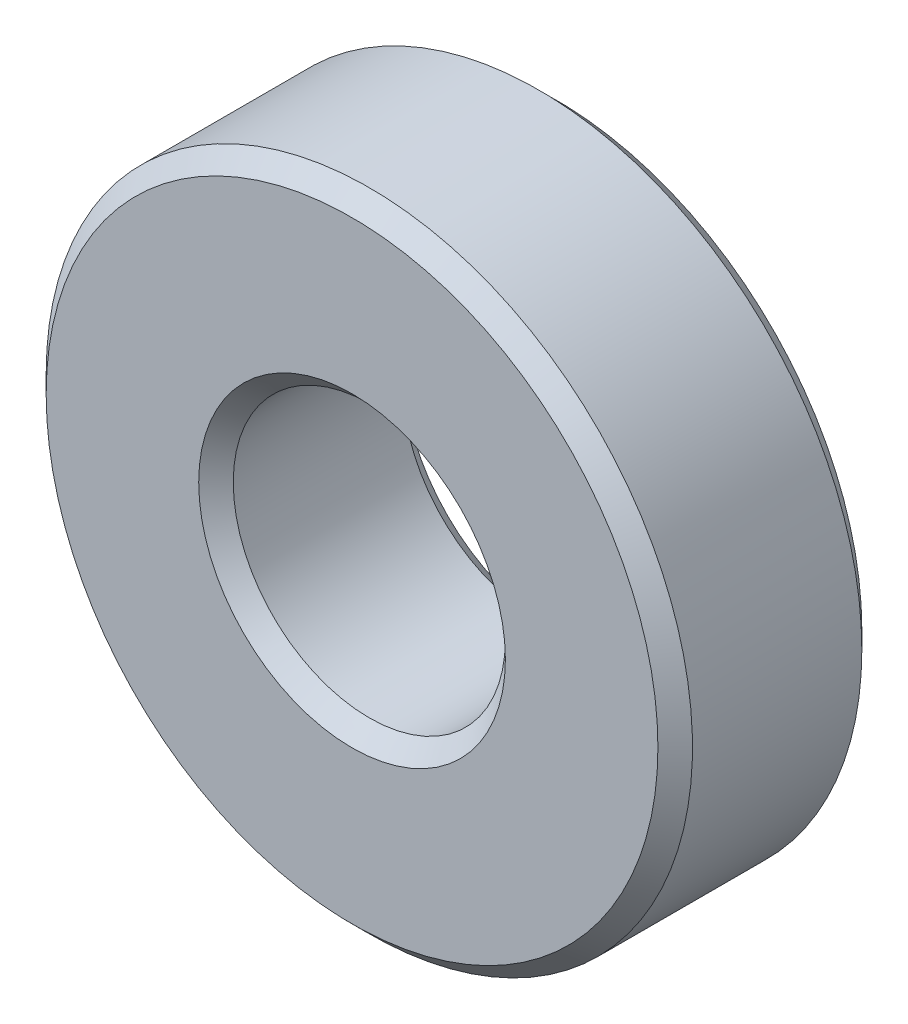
ISO-10303-21;
HEADER;
FILE_DESCRIPTION(('STEP AP214'),'2;1');
FILE_NAME('part.step','',(''),(''),'','','');
FILE_SCHEMA(('AUTOMOTIVE_DESIGN { 1 0 10303 214 1 1 1 1 }'));
ENDSEC;
DATA;
#1=APPLICATION_CONTEXT('core data for automotive mechanical design processes');
#2=APPLICATION_PROTOCOL_DEFINITION('international standard','automotive_design',2000,#1);
#3=PRODUCT_CONTEXT('',#1,'mechanical');
#4=PRODUCT('Part','Part','',(#3));
#5=PRODUCT_RELATED_PRODUCT_CATEGORY('part','',(#4));
#6=PRODUCT_DEFINITION_FORMATION('','',#4);
#7=PRODUCT_DEFINITION_CONTEXT('part definition',#1,'design');
#8=PRODUCT_DEFINITION('design','',#6,#7);
#9=PRODUCT_DEFINITION_SHAPE('','',#8);
#10=(LENGTH_UNIT() NAMED_UNIT(*) SI_UNIT(.MILLI.,.METRE.));
#11=(NAMED_UNIT(*) PLANE_ANGLE_UNIT() SI_UNIT($,.RADIAN.));
#12=(NAMED_UNIT(*) SI_UNIT($,.STERADIAN.) SOLID_ANGLE_UNIT());
#13=UNCERTAINTY_MEASURE_WITH_UNIT(LENGTH_MEASURE(1.E-05),#10,'distance_accuracy_value','');
#14=(GEOMETRIC_REPRESENTATION_CONTEXT(3) GLOBAL_UNCERTAINTY_ASSIGNED_CONTEXT((#13)) GLOBAL_UNIT_ASSIGNED_CONTEXT((#10,
#11,#12)) REPRESENTATION_CONTEXT('',''));
#15=CARTESIAN_POINT('',(0.,0.,0.));
#16=DIRECTION('',(0.,0.,1.));
#17=DIRECTION('',(1.,0.,0.));
#18=AXIS2_PLACEMENT_3D('',#15,#16,#17);
#19=CARTESIAN_POINT('',(0.,0.,5.9944));
#20=DIRECTION('',(0.,0.,1.));
#21=DIRECTION('',(1.,0.,0.));
#22=AXIS2_PLACEMENT_3D('',#19,#20,#21);
#23=PLANE('',#22);
#24=CARTESIAN_POINT('',(0.,0.,5.9944));
#25=DIRECTION('',(0.,0.,1.));
#26=DIRECTION('',(1.,0.,0.));
#27=AXIS2_PLACEMENT_3D('',#24,#25,#26);
#28=CIRCLE('',#27,4.50800000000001);
#29=CARTESIAN_POINT('',(4.50800000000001,0.,5.9944));
#30=VERTEX_POINT('',#29);
#31=EDGE_CURVE('E10',#30,#30,#28,.F.);
#32=ORIENTED_EDGE('',*,*,#31,.T.);
#33=EDGE_LOOP('',(#32));
#34=FACE_BOUND('',#33,.T.);
#35=CARTESIAN_POINT('',(0.,0.,5.9944));
#36=DIRECTION('',(0.,0.,1.));
#37=DIRECTION('',(1.,0.,0.));
#38=AXIS2_PLACEMENT_3D('',#35,#36,#37);
#39=CIRCLE('',#38,8.99200000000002);
#40=CARTESIAN_POINT('',(8.99200000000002,0.,5.9944));
#41=VERTEX_POINT('',#40);
#42=EDGE_CURVE('E40',#41,#41,#39,.T.);
#43=ORIENTED_EDGE('',*,*,#42,.T.);
#44=EDGE_LOOP('',(#43));
#45=FACE_BOUND('',#44,.T.);
#46=ADVANCED_FACE('F33',(#34,#45),#23,.T.);
#47=CARTESIAN_POINT('',(0.,0.,0.));
#48=DIRECTION('',(0.,0.,1.));
#49=DIRECTION('',(1.,0.,0.));
#50=AXIS2_PLACEMENT_3D('',#47,#48,#49);
#51=PLANE('',#50);
#52=CARTESIAN_POINT('',(0.,0.,0.));
#53=DIRECTION('',(0.,0.,1.));
#54=DIRECTION('',(1.,0.,0.));
#55=AXIS2_PLACEMENT_3D('',#52,#53,#54);
#56=CIRCLE('',#55,4.50799999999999);
#57=CARTESIAN_POINT('',(4.50799999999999,0.,0.));
#58=VERTEX_POINT('',#57);
#59=EDGE_CURVE('E59',#58,#58,#56,.T.);
#60=ORIENTED_EDGE('',*,*,#59,.T.);
#61=EDGE_LOOP('',(#60));
#62=FACE_BOUND('',#61,.T.);
#63=CARTESIAN_POINT('',(0.,0.,0.));
#64=DIRECTION('',(0.,0.,1.));
#65=DIRECTION('',(1.,0.,0.));
#66=AXIS2_PLACEMENT_3D('',#63,#64,#65);
#67=CIRCLE('',#66,8.99199999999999);
#68=CARTESIAN_POINT('',(8.99199999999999,0.,0.));
#69=VERTEX_POINT('',#68);
#70=EDGE_CURVE('E62',#69,#69,#67,.F.);
#71=ORIENTED_EDGE('',*,*,#70,.T.);
#72=EDGE_LOOP('',(#71));
#73=FACE_BOUND('',#72,.T.);
#74=ADVANCED_FACE('F66',(#62,#73),#51,.F.);
#75=CARTESIAN_POINT('',(0.,0.,5.9944));
#76=DIRECTION('',(0.,0.,-1.));
#77=DIRECTION('',(-1.,0.,0.));
#78=AXIS2_PLACEMENT_3D('',#75,#76,#77);
#79=CYLINDRICAL_SURFACE('',#78,9.5);
#80=CARTESIAN_POINT('',(0.,0.,0.508000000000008));
#81=DIRECTION('',(0.,0.,1.));
#82=DIRECTION('',(1.,0.,0.));
#83=AXIS2_PLACEMENT_3D('',#80,#81,#82);
#84=CIRCLE('',#83,9.5);
#85=CARTESIAN_POINT('',(-9.5,0.,0.508000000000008));
#86=VERTEX_POINT('',#85);
#87=EDGE_CURVE('E44',#86,#86,#84,.T.);
#88=CARTESIAN_POINT('',(0.,0.,5.48640000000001));
#89=DIRECTION('',(0.,0.,1.));
#90=DIRECTION('',(1.,0.,0.));
#91=AXIS2_PLACEMENT_3D('',#88,#89,#90);
#92=CIRCLE('',#91,9.5);
#93=CARTESIAN_POINT('',(-9.5,0.,5.48640000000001));
#94=VERTEX_POINT('',#93);
#95=EDGE_CURVE('E48',#94,#94,#92,.F.);
#96=CARTESIAN_POINT('',(-9.5,0.,0.508000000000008));
#97=CARTESIAN_POINT('',(-9.5,0.,0.559858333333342));
#98=CARTESIAN_POINT('',(-9.5,0.,0.611716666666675));
#99=CARTESIAN_POINT('',(-9.5,0.,0.715433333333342));
#100=CARTESIAN_POINT('',(-9.5,0.,0.767291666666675));
#101=CARTESIAN_POINT('',(-9.5,0.,0.871008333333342));
#102=CARTESIAN_POINT('',(-9.5,0.,0.922866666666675));
#103=CARTESIAN_POINT('',(-9.5,0.,1.02658333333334));
#104=CARTESIAN_POINT('',(-9.5,0.,1.07844166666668));
#105=CARTESIAN_POINT('',(-9.5,0.,1.18215833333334));
#106=CARTESIAN_POINT('',(-9.5,0.,1.23401666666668));
#107=CARTESIAN_POINT('',(-9.5,0.,1.33773333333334));
#108=CARTESIAN_POINT('',(-9.5,0.,1.38959166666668));
#109=CARTESIAN_POINT('',(-9.5,0.,1.49330833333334));
#110=CARTESIAN_POINT('',(-9.5,0.,1.54516666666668));
#111=CARTESIAN_POINT('',(-9.5,0.,1.64888333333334));
#112=CARTESIAN_POINT('',(-9.5,0.,1.70074166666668));
#113=CARTESIAN_POINT('',(-9.5,0.,1.80445833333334));
#114=CARTESIAN_POINT('',(-9.5,0.,1.85631666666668));
#115=CARTESIAN_POINT('',(-9.5,0.,1.96003333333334));
#116=CARTESIAN_POINT('',(-9.5,0.,2.01189166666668));
#117=CARTESIAN_POINT('',(-9.5,0.,2.11560833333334));
#118=CARTESIAN_POINT('',(-9.5,0.,2.16746666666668));
#119=CARTESIAN_POINT('',(-9.5,0.,2.27118333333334));
#120=CARTESIAN_POINT('',(-9.5,0.,2.32304166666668));
#121=CARTESIAN_POINT('',(-9.5,0.,2.42675833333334));
#122=CARTESIAN_POINT('',(-9.5,0.,2.47861666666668));
#123=CARTESIAN_POINT('',(-9.5,0.,2.58233333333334));
#124=CARTESIAN_POINT('',(-9.5,0.,2.63419166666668));
#125=CARTESIAN_POINT('',(-9.5,0.,2.73790833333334));
#126=CARTESIAN_POINT('',(-9.5,0.,2.78976666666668));
#127=CARTESIAN_POINT('',(-9.5,0.,2.89348333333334));
#128=CARTESIAN_POINT('',(-9.5,0.,2.94534166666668));
#129=CARTESIAN_POINT('',(-9.5,0.,3.04905833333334));
#130=CARTESIAN_POINT('',(-9.5,0.,3.10091666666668));
#131=CARTESIAN_POINT('',(-9.5,0.,3.20463333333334));
#132=CARTESIAN_POINT('',(-9.5,0.,3.25649166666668));
#133=CARTESIAN_POINT('',(-9.5,0.,3.36020833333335));
#134=CARTESIAN_POINT('',(-9.5,0.,3.41206666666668));
#135=CARTESIAN_POINT('',(-9.5,0.,3.51578333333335));
#136=CARTESIAN_POINT('',(-9.5,0.,3.56764166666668));
#137=CARTESIAN_POINT('',(-9.5,0.,3.67135833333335));
#138=CARTESIAN_POINT('',(-9.5,0.,3.72321666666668));
#139=CARTESIAN_POINT('',(-9.5,0.,3.82693333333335));
#140=CARTESIAN_POINT('',(-9.5,0.,3.87879166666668));
#141=CARTESIAN_POINT('',(-9.5,0.,3.98250833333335));
#142=CARTESIAN_POINT('',(-9.5,0.,4.03436666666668));
#143=CARTESIAN_POINT('',(-9.5,0.,4.13808333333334));
#144=CARTESIAN_POINT('',(-9.5,0.,4.18994166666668));
#145=CARTESIAN_POINT('',(-9.5,0.,4.29365833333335));
#146=CARTESIAN_POINT('',(-9.5,0.,4.34551666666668));
#147=CARTESIAN_POINT('',(-9.5,0.,4.44923333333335));
#148=CARTESIAN_POINT('',(-9.5,0.,4.50109166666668));
#149=CARTESIAN_POINT('',(-9.5,0.,4.60480833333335));
#150=CARTESIAN_POINT('',(-9.5,0.,4.65666666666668));
#151=CARTESIAN_POINT('',(-9.5,0.,4.76038333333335));
#152=CARTESIAN_POINT('',(-9.5,0.,4.81224166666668));
#153=CARTESIAN_POINT('',(-9.5,0.,4.91595833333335));
#154=CARTESIAN_POINT('',(-9.5,0.,4.96781666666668));
#155=CARTESIAN_POINT('',(-9.5,0.,5.07153333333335));
#156=CARTESIAN_POINT('',(-9.5,0.,5.12339166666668));
#157=CARTESIAN_POINT('',(-9.5,0.,5.22710833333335));
#158=CARTESIAN_POINT('',(-9.5,0.,5.27896666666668));
#159=CARTESIAN_POINT('',(-9.5,0.,5.38268333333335));
#160=CARTESIAN_POINT('',(-9.5,0.,5.43454166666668));
#161=CARTESIAN_POINT('',(-9.5,0.,5.48640000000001));
#162=B_SPLINE_CURVE_WITH_KNOTS('',3,(#96,#97,#98,#99,#100,#101,#102,#103,#104,#105,#106,#107,
#108,#109,#110,#111,#112,#113,#114,#115,#116,#117,#118,#119,#120,#121,#122,#123,#124,#125,#126,
#127,#128,#129,#130,#131,#132,#133,#134,#135,#136,#137,#138,#139,#140,#141,#142,#143,#144,#145,
#146,#147,#148,#149,#150,#151,#152,#153,#154,#155,#156,#157,#158,#159,#160,#161),.UNSPECIFIED.,
.F.,.F.,(4,2,2,2,2,2,2,2,2,2,2,2,2,2,2,2,2,2,2,2,2,2,2,2,2,2,2,2,2,2,2,2,4),(0.,0.155575,
0.31115,0.466725,0.622300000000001,0.777875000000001,0.933450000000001,1.089025,1.2446,1.400175,
1.55575,1.711325,1.8669,2.022475,2.17805,2.333625,2.4892,2.644775,2.80035,2.955925,3.1115,
3.267075,3.42265,3.578225,3.7338,3.889375,4.04495,4.200525,4.3561,4.511675,4.66725,
4.82282500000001,4.97840000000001),.UNSPECIFIED.);
#163=EDGE_CURVE('BSEAM76',#86,#94,#162,.T.);
#164=ORIENTED_EDGE('',*,*,#87,.T.);
#165=ORIENTED_EDGE('',*,*,#95,.T.);
#166=ORIENTED_EDGE('',*,*,#163,.T.);
#167=ORIENTED_EDGE('',*,*,#163,.F.);
#168=EDGE_LOOP('',(#164,#166,#165,#167));
#169=FACE_BOUND('',#168,.T.);
#170=ADVANCED_FACE('F76',(#169),#79,.T.);
#171=CARTESIAN_POINT('',(0.,0.,5.9944));
#172=DIRECTION('',(0.,0.,-1.));
#173=DIRECTION('',(-1.,0.,0.));
#174=AXIS2_PLACEMENT_3D('',#171,#172,#173);
#175=CYLINDRICAL_SURFACE('',#174,4.);
#176=CARTESIAN_POINT('',(0.,0.,0.507999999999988));
#177=DIRECTION('',(0.,0.,1.));
#178=DIRECTION('',(1.,0.,0.));
#179=AXIS2_PLACEMENT_3D('',#176,#177,#178);
#180=CIRCLE('',#179,4.);
#181=CARTESIAN_POINT('',(-4.,0.,0.507999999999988));
#182=VERTEX_POINT('',#181);
#183=EDGE_CURVE('E53',#182,#182,#180,.F.);
#184=CARTESIAN_POINT('',(0.,0.,5.48639999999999));
#185=DIRECTION('',(0.,0.,1.));
#186=DIRECTION('',(1.,0.,0.));
#187=AXIS2_PLACEMENT_3D('',#184,#185,#186);
#188=CIRCLE('',#187,4.);
#189=CARTESIAN_POINT('',(-4.,0.,5.48639999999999));
#190=VERTEX_POINT('',#189);
#191=EDGE_CURVE('E56',#190,#190,#188,.T.);
#192=CARTESIAN_POINT('',(-4.,0.,0.507999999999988));
#193=CARTESIAN_POINT('',(-4.,0.,0.559858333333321));
#194=CARTESIAN_POINT('',(-4.,0.,0.611716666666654));
#195=CARTESIAN_POINT('',(-4.,0.,0.715433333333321));
#196=CARTESIAN_POINT('',(-4.,0.,0.767291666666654));
#197=CARTESIAN_POINT('',(-4.,0.,0.871008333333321));
#198=CARTESIAN_POINT('',(-4.,0.,0.922866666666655));
#199=CARTESIAN_POINT('',(-4.,0.,1.02658333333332));
#200=CARTESIAN_POINT('',(-4.,0.,1.07844166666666));
#201=CARTESIAN_POINT('',(-4.,0.,1.18215833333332));
#202=CARTESIAN_POINT('',(-4.,0.,1.23401666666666));
#203=CARTESIAN_POINT('',(-4.,0.,1.33773333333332));
#204=CARTESIAN_POINT('',(-4.,0.,1.38959166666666));
#205=CARTESIAN_POINT('',(-4.,0.,1.49330833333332));
#206=CARTESIAN_POINT('',(-4.,0.,1.54516666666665));
#207=CARTESIAN_POINT('',(-4.,0.,1.64888333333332));
#208=CARTESIAN_POINT('',(-4.,0.,1.70074166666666));
#209=CARTESIAN_POINT('',(-4.,0.,1.80445833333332));
#210=CARTESIAN_POINT('',(-4.,0.,1.85631666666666));
#211=CARTESIAN_POINT('',(-4.,0.,1.96003333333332));
#212=CARTESIAN_POINT('',(-4.,0.,2.01189166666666));
#213=CARTESIAN_POINT('',(-4.,0.,2.11560833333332));
#214=CARTESIAN_POINT('',(-4.,0.,2.16746666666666));
#215=CARTESIAN_POINT('',(-4.,0.,2.27118333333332));
#216=CARTESIAN_POINT('',(-4.,0.,2.32304166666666));
#217=CARTESIAN_POINT('',(-4.,0.,2.42675833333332));
#218=CARTESIAN_POINT('',(-4.,0.,2.47861666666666));
#219=CARTESIAN_POINT('',(-4.,0.,2.58233333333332));
#220=CARTESIAN_POINT('',(-4.,0.,2.63419166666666));
#221=CARTESIAN_POINT('',(-4.,0.,2.73790833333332));
#222=CARTESIAN_POINT('',(-4.,0.,2.78976666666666));
#223=CARTESIAN_POINT('',(-4.,0.,2.89348333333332));
#224=CARTESIAN_POINT('',(-4.,0.,2.94534166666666));
#225=CARTESIAN_POINT('',(-4.,0.,3.04905833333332));
#226=CARTESIAN_POINT('',(-4.,0.,3.10091666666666));
#227=CARTESIAN_POINT('',(-4.,0.,3.20463333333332));
#228=CARTESIAN_POINT('',(-4.,0.,3.25649166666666));
#229=CARTESIAN_POINT('',(-4.,0.,3.36020833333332));
#230=CARTESIAN_POINT('',(-4.,0.,3.41206666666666));
#231=CARTESIAN_POINT('',(-4.,0.,3.51578333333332));
#232=CARTESIAN_POINT('',(-4.,0.,3.56764166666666));
#233=CARTESIAN_POINT('',(-4.,0.,3.67135833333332));
#234=CARTESIAN_POINT('',(-4.,0.,3.72321666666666));
#235=CARTESIAN_POINT('',(-4.,0.,3.82693333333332));
#236=CARTESIAN_POINT('',(-4.,0.,3.87879166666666));
#237=CARTESIAN_POINT('',(-4.,0.,3.98250833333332));
#238=CARTESIAN_POINT('',(-4.,0.,4.03436666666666));
#239=CARTESIAN_POINT('',(-4.,0.,4.13808333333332));
#240=CARTESIAN_POINT('',(-4.,0.,4.18994166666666));
#241=CARTESIAN_POINT('',(-4.,0.,4.29365833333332));
#242=CARTESIAN_POINT('',(-4.,0.,4.34551666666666));
#243=CARTESIAN_POINT('',(-4.,0.,4.44923333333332));
#244=CARTESIAN_POINT('',(-4.,0.,4.50109166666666));
#245=CARTESIAN_POINT('',(-4.,0.,4.60480833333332));
#246=CARTESIAN_POINT('',(-4.,0.,4.65666666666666));
#247=CARTESIAN_POINT('',(-4.,0.,4.76038333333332));
#248=CARTESIAN_POINT('',(-4.,0.,4.81224166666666));
#249=CARTESIAN_POINT('',(-4.,0.,4.91595833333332));
#250=CARTESIAN_POINT('',(-4.,0.,4.96781666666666));
#251=CARTESIAN_POINT('',(-4.,0.,5.07153333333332));
#252=CARTESIAN_POINT('',(-4.,0.,5.12339166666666));
#253=CARTESIAN_POINT('',(-4.,0.,5.22710833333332));
#254=CARTESIAN_POINT('',(-4.,0.,5.27896666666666));
#255=CARTESIAN_POINT('',(-4.,0.,5.38268333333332));
#256=CARTESIAN_POINT('',(-4.,0.,5.43454166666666));
#257=CARTESIAN_POINT('',(-4.,0.,5.48639999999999));
#258=B_SPLINE_CURVE_WITH_KNOTS('',3,(#192,#193,#194,#195,#196,#197,#198,#199,#200,#201,#202,
#203,#204,#205,#206,#207,#208,#209,#210,#211,#212,#213,#214,#215,#216,#217,#218,#219,#220,#221,
#222,#223,#224,#225,#226,#227,#228,#229,#230,#231,#232,#233,#234,#235,#236,#237,#238,#239,#240,
#241,#242,#243,#244,#245,#246,#247,#248,#249,#250,#251,#252,#253,#254,#255,#256,#257),
.UNSPECIFIED.,.F.,.F.,(4,2,2,2,2,2,2,2,2,2,2,2,2,2,2,2,2,2,2,2,2,2,2,2,2,2,2,2,2,2,2,2,4),(0.,
0.155575,0.31115,0.466725,0.622300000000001,0.777875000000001,0.933450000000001,1.089025,1.2446,
1.400175,1.55575,1.711325,1.8669,2.022475,2.17805,2.333625,2.4892,2.644775,2.80035,2.955925,
3.1115,3.267075,3.42265,3.578225,3.7338,3.889375,4.04495,4.200525,4.3561,4.511675,4.66725,
4.822825,4.9784),.UNSPECIFIED.);
#259=EDGE_CURVE('BSEAM79',#182,#190,#258,.T.);
#260=ORIENTED_EDGE('',*,*,#183,.T.);
#261=ORIENTED_EDGE('',*,*,#191,.T.);
#262=ORIENTED_EDGE('',*,*,#259,.T.);
#263=ORIENTED_EDGE('',*,*,#259,.F.);
#264=EDGE_LOOP('',(#260,#262,#261,#263));
#265=FACE_BOUND('',#264,.T.);
#266=ADVANCED_FACE('F79',(#265),#175,.F.);
#267=CARTESIAN_POINT('',(0.,0.,0.));
#268=DIRECTION('',(0.,0.,-1.));
#269=DIRECTION('',(-1.,0.,0.));
#270=AXIS2_PLACEMENT_3D('',#267,#268,#269);
#271=CONICAL_SURFACE('',#270,4.50799999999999,0.785398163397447);
#272=ORIENTED_EDGE('',*,*,#183,.F.);
#273=EDGE_LOOP('',(#272));
#274=FACE_BOUND('',#273,.T.);
#275=ORIENTED_EDGE('',*,*,#59,.F.);
#276=EDGE_LOOP('',(#275));
#277=FACE_BOUND('',#276,.T.);
#278=ADVANCED_FACE('F72',(#274,#277),#271,.F.);
#279=CARTESIAN_POINT('',(0.,0.,0.508000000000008));
#280=DIRECTION('',(0.,0.,1.));
#281=DIRECTION('',(1.,0.,0.));
#282=AXIS2_PLACEMENT_3D('',#279,#280,#281);
#283=CONICAL_SURFACE('',#282,9.5,0.785398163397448);
#284=ORIENTED_EDGE('',*,*,#70,.F.);
#285=EDGE_LOOP('',(#284));
#286=FACE_BOUND('',#285,.T.);
#287=ORIENTED_EDGE('',*,*,#87,.F.);
#288=EDGE_LOOP('',(#287));
#289=FACE_BOUND('',#288,.T.);
#290=ADVANCED_FACE('F68',(#286,#289),#283,.T.);
#291=CARTESIAN_POINT('',(0.,0.,5.48639999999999));
#292=DIRECTION('',(0.,0.,1.));
#293=DIRECTION('',(1.,0.,0.));
#294=AXIS2_PLACEMENT_3D('',#291,#292,#293);
#295=CONICAL_SURFACE('',#294,4.,0.785398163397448);
#296=ORIENTED_EDGE('',*,*,#31,.F.);
#297=EDGE_LOOP('',(#296));
#298=FACE_BOUND('',#297,.T.);
#299=ORIENTED_EDGE('',*,*,#191,.F.);
#300=EDGE_LOOP('',(#299));
#301=FACE_BOUND('',#300,.T.);
#302=ADVANCED_FACE('F71',(#298,#301),#295,.F.);
#303=CARTESIAN_POINT('',(0.,0.,5.9944));
#304=DIRECTION('',(0.,0.,-1.));
#305=DIRECTION('',(-1.,0.,0.));
#306=AXIS2_PLACEMENT_3D('',#303,#304,#305);
#307=CONICAL_SURFACE('',#306,8.99200000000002,0.785398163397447);
#308=ORIENTED_EDGE('',*,*,#95,.F.);
#309=EDGE_LOOP('',(#308));
#310=FACE_BOUND('',#309,.T.);
#311=ORIENTED_EDGE('',*,*,#42,.F.);
#312=EDGE_LOOP('',(#311));
#313=FACE_BOUND('',#312,.T.);
#314=ADVANCED_FACE('F35',(#310,#313),#307,.T.);
#315=CLOSED_SHELL('',(#46,#74,#170,#266,#278,#290,#302,#314));
#316=MANIFOLD_SOLID_BREP('B2',#315);
#317=ADVANCED_BREP_SHAPE_REPRESENTATION('',(#18,#316),#14);
#318=SHAPE_DEFINITION_REPRESENTATION(#9,#317);
ENDSEC;
END-ISO-10303-21;
